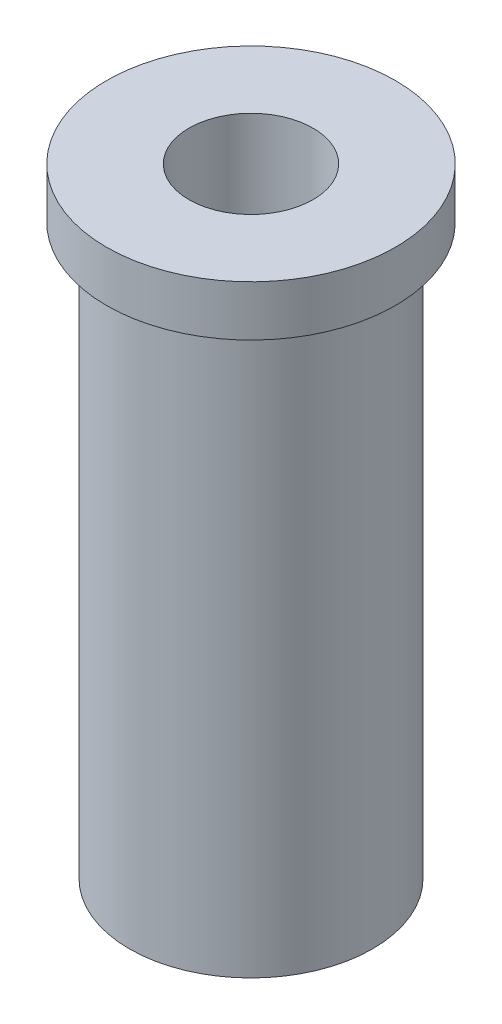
from build123d import *


with BuildPart() as part:
    # Esquisse1 → R_volution1 (revolve)
    with BuildSketch(Plane.XY, mode=Mode.PRIVATE) as r_volution1_sk:
        Polygon((2.04, 0), (4.75, 0), (4.75, -1.66), (4, -1.66), (4, -20.36), (2.04, -20.36), align=None)
    revolve(r_volution1_sk.sketch.rotate(Axis((0, 0, 0), (0, -1, 0)), 90), axis=Axis((0, 0, 0), (0, -1, 0)))


solid = part.part
